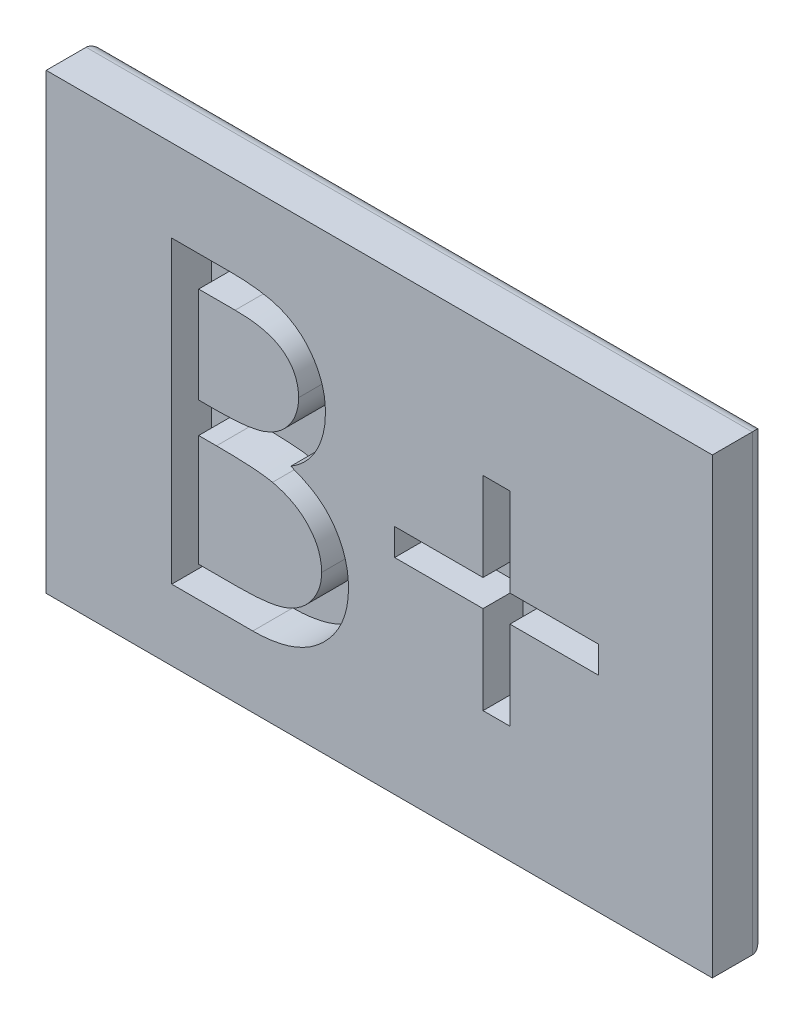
from build123d import *

# Parameters (mm, degrees)
SKETCH1_W           = 31.75
SKETCH1_H           = 21.59
BOSS_EXTRUDE1_DEPTH = 2.54
FILLET1_R           = 0.635
CUT_EXTRUDE1_DEPTH  = 1.905


with BuildPart() as part:
    # Sketch1 → Boss-Extrude1 (new body)
    with BuildSketch(Plane.XY):
        Rectangle(SKETCH1_W, SKETCH1_H)
    extrude(amount=BOSS_EXTRUDE1_DEPTH)

    # Fillet1
    fillet1_edges = [part.edges().sort_by_distance(p)[0] for p in [
        (0, -10.795, 0),
        (-15.875, 0, 0),
        (0, 10.795, 0),
        (15.875, 0, 0),
    ]]
    fillet(fillet1_edges, radius=FILLET1_R)

    # Sketch2 → Cut-Extrude1 (cut)
    # profile 1 of 2: a face of its own
    with BuildSketch(Plane.XY.offset(2.54)):
        with BuildLine():
            Line((-9.891346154, 6.864769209), (-7.103680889, 6.864769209))
            add(Edge.make_bspline(
                [(-7.103680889, 6.864769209), (-6.967221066, 6.864051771), (-6.702727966, 6.862661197), (-6.318110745, 6.841094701), (-5.957866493, 6.811688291), (-5.621890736, 6.76502902), (-5.310338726, 6.708729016), (-5.02227155, 6.640549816), (-4.75860524, 6.558798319), (-4.443820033, 6.428797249), (-4.084915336, 6.235617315), (-3.696301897, 5.950158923), (-3.363998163, 5.601003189), (-3.077487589, 5.207147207), (-2.849699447, 4.773885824), (-2.684906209, 4.311545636), (-2.58057531, 3.826090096), (-2.569845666, 3.492810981), (-2.564423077, 3.324377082)],
                knots=[0, 0, 0, 0, 1.001505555, 1.941167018, 2.826882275, 3.653841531, 4.429895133, 5.150066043, 5.825578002, 6.45369114, 7.647487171, 8.808567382, 9.977351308, 11.170798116, 12.373658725, 13.556498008, 14.765093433, 16, 16, 16, 16], degree=3))
            add(Edge.make_bspline(
                [(-2.564423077, 3.324377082), (-2.568885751, 3.166591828), (-2.577655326, 2.856528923), (-2.661513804, 2.403026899), (-2.792798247, 1.971335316), (-2.975291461, 1.56302965), (-3.212472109, 1.187335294), (-3.493561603, 0.841221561), (-3.832692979, 0.539342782), (-4.086778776, 0.370575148), (-4.215842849, 0.284848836)],
                knots=[0, 0, 0, 0, 1.044552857, 2.05264487, 3.044412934, 4.028983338, 5.005914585, 5.980388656, 6.974128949, 8, 8, 8, 8], degree=3))
            add(Edge.make_bspline(
                [(-4.215842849, 0.284848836), (-4.053535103, 0.22253493), (-3.743000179, 0.103312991), (-3.315656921, -0.10747035), (-2.947468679, -0.336732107), (-2.635604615, -0.587097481), (-2.368886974, -0.856963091), (-2.135988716, -1.150285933), (-1.937264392, -1.470892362), (-1.766986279, -1.815439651), (-1.634117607, -2.180409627), (-1.534611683, -2.562378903), (-1.477594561, -2.959977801), (-1.469480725, -3.230564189), (-1.465384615, -3.367164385)],
                knots=[0, 0, 0, 0, 1.27268992, 2.434971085, 3.483601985, 4.442670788, 5.356604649, 6.2567628, 7.179492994, 8.113709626, 9.066344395, 10.018646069, 10.999752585, 12, 12, 12, 12], degree=3))
            add(Edge.make_bspline(
                [(-1.465384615, -3.367164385), (-1.46937224, -3.506638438), (-1.477218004, -3.781057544), (-1.535102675, -4.184190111), (-1.63311128, -4.569442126), (-1.768112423, -4.939305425), (-1.944307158, -5.293064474), (-2.158733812, -5.631120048), (-2.414404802, -5.950075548), (-2.700411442, -6.253475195), (-3.023970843, -6.52627577), (-3.373058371, -6.769227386), (-3.752070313, -6.969032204), (-4.154781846, -7.136873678), (-4.585710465, -7.265082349), (-5.042921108, -7.354777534), (-5.526019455, -7.41521381), (-5.85752926, -7.420182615), (-6.027539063, -7.422730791)],
                knots=[0, 0, 0, 0, 0.978564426, 1.925352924, 2.850884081, 3.763762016, 4.682927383, 5.618979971, 6.567305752, 7.547517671, 8.540179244, 9.531824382, 10.526200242, 11.540722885, 12.589160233, 13.674978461, 14.80764778, 16, 16, 16, 16], degree=3))
            Line((-6.027539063, -7.422730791), (-9.891346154, -7.422730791))
            Line((-9.891346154, -7.422730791), (-9.891346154, 6.864769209))
        make_face()
        with BuildLine():
            Line((-8.609134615, 5.399384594), (-8.609134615, 0.820057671))
            Line((-8.609134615, 0.820057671), (-7.747648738, 0.820057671))
            add(Edge.make_bspline(
                [(-7.747648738, 0.820057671), (-7.621719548, 0.821690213), (-7.378398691, 0.824844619), (-7.026028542, 0.833880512), (-6.698946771, 0.85918181), (-6.397717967, 0.884475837), (-6.12281649, 0.925601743), (-5.87485137, 0.974555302), (-5.649931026, 1.026328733), (-5.390553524, 1.11437846), (-5.096341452, 1.244507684), (-4.782697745, 1.446458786), (-4.506195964, 1.686996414), (-4.272708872, 1.964545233), (-4.081617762, 2.270159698), (-3.948892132, 2.598963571), (-3.858891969, 2.942762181), (-3.850762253, 3.178784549), (-3.846634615, 3.298618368)],
                knots=[0, 0, 0, 0, 1.156816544, 2.235205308, 3.236616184, 4.169592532, 5.011045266, 5.787822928, 6.49130361, 7.128639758, 8.301311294, 9.436451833, 10.541879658, 11.654887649, 12.756523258, 13.837046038, 14.901820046, 16, 16, 16, 16], degree=3))
            add(Edge.make_bspline(
                [(-3.846634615, 3.298618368), (-3.848782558, 3.377917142), (-3.852995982, 3.533470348), (-3.887503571, 3.760230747), (-3.946154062, 3.973497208), (-4.021487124, 4.17619238), (-4.126760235, 4.361978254), (-4.25070823, 4.537278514), (-4.400464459, 4.69612334), (-4.570923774, 4.844588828), (-4.766901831, 4.976215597), (-4.988281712, 5.091498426), (-5.23805855, 5.184329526), (-5.512022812, 5.265630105), (-5.814391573, 5.322732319), (-6.141675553, 5.370303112), (-6.496555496, 5.394521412), (-6.742076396, 5.397727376), (-6.868990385, 5.399384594)],
                knots=[0, 0, 0, 0, 0.91205012, 1.789085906, 2.630437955, 3.453916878, 4.269457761, 5.079663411, 5.91843418, 6.774407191, 7.675494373, 8.627863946, 9.638891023, 10.736472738, 11.911756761, 13.175263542, 14.539845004, 16, 16, 16, 16], degree=3))
            Line((-6.868990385, 5.399384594), (-8.609134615, 5.399384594))
        make_face(mode=Mode.SUBTRACT)
        with BuildLine():
            Line((-8.609134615, -0.645326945), (-8.609134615, -5.957346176))
            Line((-8.609134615, -5.957346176), (-6.783128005, -5.957346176))
            add(Edge.make_bspline(
                [(-6.783128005, -5.957346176), (-6.652422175, -5.955779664), (-6.40050392, -5.952760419), (-6.036779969, -5.942903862), (-5.699663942, -5.920483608), (-5.39069416, -5.885190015), (-5.106534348, -5.846905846), (-4.850593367, -5.795424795), (-4.620796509, -5.736442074), (-4.35433746, -5.645270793), (-4.054285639, -5.503634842), (-3.730935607, -5.290080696), (-3.443445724, -5.03566805), (-3.199312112, -4.741219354), (-2.999234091, -4.421051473), (-2.85368343, -4.081640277), (-2.763913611, -3.728593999), (-2.753046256, -3.487883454), (-2.747596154, -3.367164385)],
                knots=[0, 0, 0, 0, 1.160039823, 2.235823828, 3.228722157, 4.157150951, 4.99529583, 5.772374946, 6.472645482, 7.099169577, 8.269452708, 9.405989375, 10.527446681, 11.663510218, 12.788923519, 13.866172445, 14.929861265, 16, 16, 16, 16], degree=3))
            add(Edge.make_bspline(
                [(-2.747596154, -3.367164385), (-2.748723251, -3.291671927), (-2.750959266, -3.141904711), (-2.784680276, -2.921812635), (-2.833722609, -2.708619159), (-2.897124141, -2.501745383), (-2.989460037, -2.304931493), (-3.097255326, -2.114284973), (-3.22364419, -1.929553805), (-3.420583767, -1.696005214), (-3.707035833, -1.42692255), (-4.114053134, -1.163471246), (-4.57685505, -0.951004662), (-4.912519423, -0.860791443), (-5.085914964, -0.814189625)],
                knots=[0, 0, 0, 0, 0.723448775, 1.435228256, 2.130040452, 2.821711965, 3.505591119, 4.210454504, 4.921174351, 5.648778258, 7.137944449, 8.670945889, 10.280296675, 12, 12, 12, 12], degree=3))
            add(Edge.make_bspline(
                [(-5.085914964, -0.814189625), (-5.155430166, -0.800085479), (-5.306153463, -0.76950478), (-5.551929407, -0.737224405), (-5.832519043, -0.708465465), (-6.148570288, -0.687192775), (-6.500483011, -0.665204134), (-6.88900879, -0.656652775), (-7.312560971, -0.646450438), (-7.60644412, -0.645711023), (-7.759097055, -0.645326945)],
                knots=[0, 0, 0, 0, 0.634451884, 1.375622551, 2.216452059, 3.157844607, 4.20941857, 5.370758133, 6.634282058, 8, 8, 8, 8], degree=3))
            Line((-7.759097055, -0.645326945), (-8.609134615, -0.645326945))
        make_face(mode=Mode.SUBTRACT)
    # profile 2 of 2: a face of its own
    with BuildSketch(Plane.XY.offset(2.54)):
        Polygon((4.945673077, 0.27053844), (4.945673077, 4.483519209), (6.227884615, 4.483519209), (6.227884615, 0.27053844), (10.440865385, 0.27053844), (10.440865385, -1.011673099), (6.227884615, -1.011673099), (6.227884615, -5.224653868), (4.945673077, -5.224653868), (4.945673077, -1.011673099), (0.732692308, -1.011673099), (0.732692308, 0.27053844), align=None)
    extrude(amount=-CUT_EXTRUDE1_DEPTH, mode=Mode.SUBTRACT)


solid = part.part
